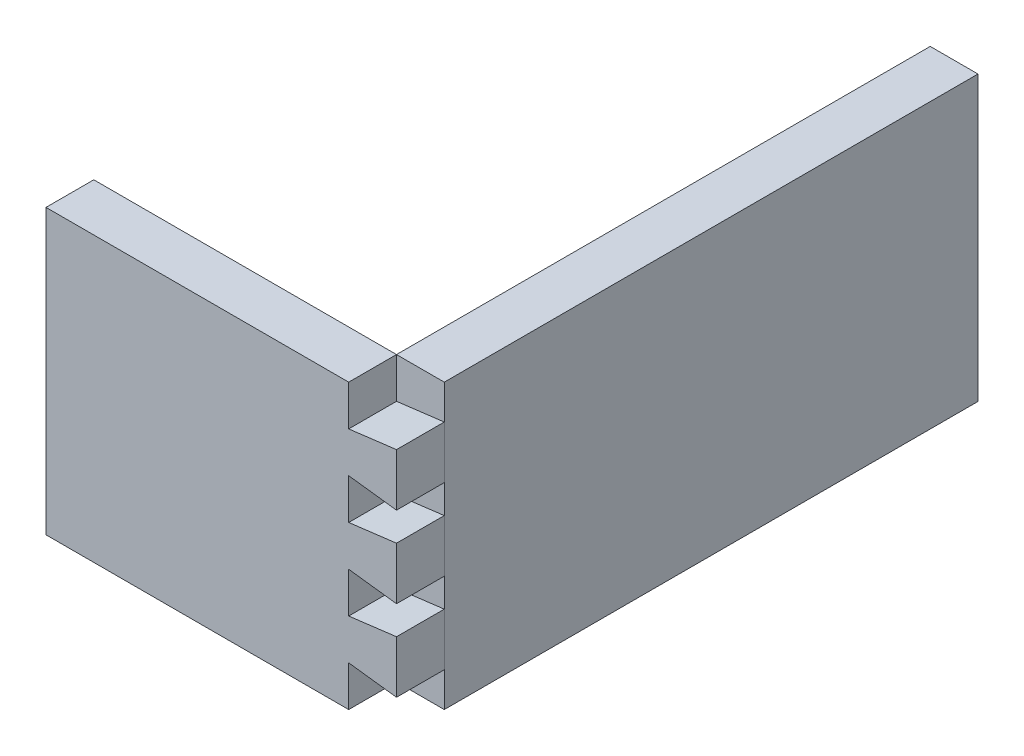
ISO-10303-21;
HEADER;
FILE_DESCRIPTION(('STEP AP214'),'2;1');
FILE_NAME('part.step','',(''),(''),'','','');
FILE_SCHEMA(('AUTOMOTIVE_DESIGN { 1 0 10303 214 1 1 1 1 }'));
ENDSEC;
DATA;
#1=APPLICATION_CONTEXT('core data for automotive mechanical design processes');
#2=APPLICATION_PROTOCOL_DEFINITION('international standard','automotive_design',2000,#1);
#3=PRODUCT_CONTEXT('',#1,'mechanical');
#4=PRODUCT('Part','Part','',(#3));
#5=PRODUCT_RELATED_PRODUCT_CATEGORY('part','',(#4));
#6=PRODUCT_DEFINITION_FORMATION('','',#4);
#7=PRODUCT_DEFINITION_CONTEXT('part definition',#1,'design');
#8=PRODUCT_DEFINITION('design','',#6,#7);
#9=PRODUCT_DEFINITION_SHAPE('','',#8);
#10=(LENGTH_UNIT() NAMED_UNIT(*) SI_UNIT(.MILLI.,.METRE.));
#11=(NAMED_UNIT(*) PLANE_ANGLE_UNIT() SI_UNIT($,.RADIAN.));
#12=(NAMED_UNIT(*) SI_UNIT($,.STERADIAN.) SOLID_ANGLE_UNIT());
#13=UNCERTAINTY_MEASURE_WITH_UNIT(LENGTH_MEASURE(1.E-05),#10,'distance_accuracy_value','');
#14=(GEOMETRIC_REPRESENTATION_CONTEXT(3) GLOBAL_UNCERTAINTY_ASSIGNED_CONTEXT((#13)) GLOBAL_UNIT_ASSIGNED_CONTEXT((#10,
#11,#12)) REPRESENTATION_CONTEXT('',''));
#15=CARTESIAN_POINT('',(0.,0.,0.));
#16=DIRECTION('',(0.,0.,1.));
#17=DIRECTION('',(1.,0.,0.));
#18=AXIS2_PLACEMENT_3D('',#15,#16,#17);
#19=CARTESIAN_POINT('',(0.,0.,0.));
#20=DIRECTION('',(0.,0.,-1.));
#21=DIRECTION('',(-1.,0.,0.));
#22=AXIS2_PLACEMENT_3D('',#19,#20,#21);
#23=PLANE('',#22);
#24=DIRECTION('',(0.,-1.,0.));
#25=VECTOR('',#24,1.);
#26=CARTESIAN_POINT('',(0.,89.,0.));
#27=LINE('',#26,#25);
#28=CARTESIAN_POINT('',(0.,89.,0.));
#29=VERTEX_POINT('',#28);
#30=CARTESIAN_POINT('',(0.,0.,0.));
#31=VERTEX_POINT('',#30);
#32=EDGE_CURVE('E12',#29,#31,#27,.T.);
#33=ORIENTED_EDGE('',*,*,#32,.F.);
#34=DIRECTION('',(1.,0.,0.));
#35=VECTOR('',#34,1.);
#36=CARTESIAN_POINT('',(0.,89.,0.));
#37=LINE('',#36,#35);
#38=CARTESIAN_POINT('',(-15.,89.,0.));
#39=VERTEX_POINT('',#38);
#40=EDGE_CURVE('E96',#39,#29,#37,.T.);
#41=ORIENTED_EDGE('',*,*,#40,.F.);
#42=DIRECTION('',(0.,1.,0.));
#43=VECTOR('',#42,1.);
#44=CARTESIAN_POINT('',(-15.,89.,0.));
#45=LINE('',#44,#43);
#46=CARTESIAN_POINT('',(-15.,0.,0.));
#47=VERTEX_POINT('',#46);
#48=EDGE_CURVE('E50',#47,#39,#45,.T.);
#49=ORIENTED_EDGE('',*,*,#48,.F.);
#50=DIRECTION('',(-1.,0.,0.));
#51=VECTOR('',#50,1.);
#52=CARTESIAN_POINT('',(0.,0.,0.));
#53=LINE('',#52,#51);
#54=EDGE_CURVE('E56',#31,#47,#53,.T.);
#55=ORIENTED_EDGE('',*,*,#54,.F.);
#56=EDGE_LOOP('',(#33,#41,#49,#55));
#57=FACE_BOUND('',#56,.T.);
#58=ADVANCED_FACE('F47',(#57),#23,.F.);
#59=CARTESIAN_POINT('',(0.,0.,-167.5));
#60=DIRECTION('',(0.,0.,-1.));
#61=DIRECTION('',(-1.,0.,0.));
#62=AXIS2_PLACEMENT_3D('',#59,#60,#61);
#63=PLANE('',#62);
#64=DIRECTION('',(0.,-1.,0.));
#65=VECTOR('',#64,1.);
#66=CARTESIAN_POINT('',(0.,89.,-167.5));
#67=LINE('',#66,#65);
#68=CARTESIAN_POINT('',(0.,89.,-167.5));
#69=VERTEX_POINT('',#68);
#70=CARTESIAN_POINT('',(0.,0.,-167.5));
#71=VERTEX_POINT('',#70);
#72=EDGE_CURVE('E88',#69,#71,#67,.T.);
#73=ORIENTED_EDGE('',*,*,#72,.T.);
#74=DIRECTION('',(-1.,0.,0.));
#75=VECTOR('',#74,1.);
#76=CARTESIAN_POINT('',(0.,0.,-167.5));
#77=LINE('',#76,#75);
#78=CARTESIAN_POINT('',(-15.,0.,-167.5));
#79=VERTEX_POINT('',#78);
#80=EDGE_CURVE('E78',#71,#79,#77,.T.);
#81=ORIENTED_EDGE('',*,*,#80,.T.);
#82=DIRECTION('',(0.,1.,0.));
#83=VECTOR('',#82,1.);
#84=CARTESIAN_POINT('',(-15.,89.,-167.5));
#85=LINE('',#84,#83);
#86=CARTESIAN_POINT('',(-15.,89.,-167.5));
#87=VERTEX_POINT('',#86);
#88=EDGE_CURVE('E89',#79,#87,#85,.T.);
#89=ORIENTED_EDGE('',*,*,#88,.T.);
#90=DIRECTION('',(1.,0.,0.));
#91=VECTOR('',#90,1.);
#92=CARTESIAN_POINT('',(0.,89.,-167.5));
#93=LINE('',#92,#91);
#94=EDGE_CURVE('E94',#87,#69,#93,.T.);
#95=ORIENTED_EDGE('',*,*,#94,.T.);
#96=EDGE_LOOP('',(#73,#81,#89,#95));
#97=FACE_BOUND('',#96,.T.);
#98=ADVANCED_FACE('F92',(#97),#63,.T.);
#99=CARTESIAN_POINT('',(0.,89.,-167.5));
#100=DIRECTION('',(0.,-1.,0.));
#101=DIRECTION('',(0.,0.,-1.));
#102=AXIS2_PLACEMENT_3D('',#99,#100,#101);
#103=PLANE('',#102);
#104=ORIENTED_EDGE('',*,*,#40,.T.);
#105=DIRECTION('',(0.,0.,1.));
#106=VECTOR('',#105,1.);
#107=CARTESIAN_POINT('',(0.,89.,-167.5));
#108=LINE('',#107,#106);
#109=EDGE_CURVE('E105',#69,#29,#108,.T.);
#110=ORIENTED_EDGE('',*,*,#109,.F.);
#111=ORIENTED_EDGE('',*,*,#94,.F.);
#112=DIRECTION('',(0.,0.,1.));
#113=VECTOR('',#112,1.);
#114=CARTESIAN_POINT('',(-15.,89.,-167.5));
#115=LINE('',#114,#113);
#116=EDGE_CURVE('E100',#87,#39,#115,.T.);
#117=ORIENTED_EDGE('',*,*,#116,.T.);
#118=EDGE_LOOP('',(#104,#110,#111,#117));
#119=FACE_BOUND('',#118,.T.);
#120=ADVANCED_FACE('F118',(#119),#103,.F.);
#121=CARTESIAN_POINT('',(0.,89.,-167.5));
#122=DIRECTION('',(-1.,0.,0.));
#123=DIRECTION('',(0.,-1.,0.));
#124=AXIS2_PLACEMENT_3D('',#121,#122,#123);
#125=PLANE('',#124);
#126=ORIENTED_EDGE('',*,*,#109,.T.);
#127=ORIENTED_EDGE('',*,*,#32,.T.);
#128=DIRECTION('',(0.,0.,1.));
#129=VECTOR('',#128,1.);
#130=CARTESIAN_POINT('',(0.,0.,-167.5));
#131=LINE('',#130,#129);
#132=EDGE_CURVE('E84',#71,#31,#131,.T.);
#133=ORIENTED_EDGE('',*,*,#132,.F.);
#134=ORIENTED_EDGE('',*,*,#72,.F.);
#135=EDGE_LOOP('',(#126,#127,#133,#134));
#136=FACE_BOUND('',#135,.T.);
#137=ADVANCED_FACE('F98',(#136),#125,.F.);
#138=CARTESIAN_POINT('',(0.,0.,-167.5));
#139=DIRECTION('',(0.,1.,0.));
#140=DIRECTION('',(-1.,0.,0.));
#141=AXIS2_PLACEMENT_3D('',#138,#139,#140);
#142=PLANE('',#141);
#143=ORIENTED_EDGE('',*,*,#54,.T.);
#144=DIRECTION('',(0.,0.,1.));
#145=VECTOR('',#144,1.);
#146=CARTESIAN_POINT('',(-15.,0.,-167.5));
#147=LINE('',#146,#145);
#148=EDGE_CURVE('E86',#79,#47,#147,.T.);
#149=ORIENTED_EDGE('',*,*,#148,.F.);
#150=ORIENTED_EDGE('',*,*,#80,.F.);
#151=ORIENTED_EDGE('',*,*,#132,.T.);
#152=EDGE_LOOP('',(#143,#149,#150,#151));
#153=FACE_BOUND('',#152,.T.);
#154=ADVANCED_FACE('F83',(#153),#142,.F.);
#155=CARTESIAN_POINT('',(-15.,89.,-167.5));
#156=DIRECTION('',(1.,0.,0.));
#157=DIRECTION('',(0.,1.,0.));
#158=AXIS2_PLACEMENT_3D('',#155,#156,#157);
#159=PLANE('',#158);
#160=ORIENTED_EDGE('',*,*,#148,.T.);
#161=ORIENTED_EDGE('',*,*,#48,.T.);
#162=ORIENTED_EDGE('',*,*,#116,.F.);
#163=ORIENTED_EDGE('',*,*,#88,.F.);
#164=EDGE_LOOP('',(#160,#161,#162,#163));
#165=FACE_BOUND('',#164,.T.);
#166=ADVANCED_FACE('F114',(#165),#159,.F.);
#167=CLOSED_SHELL('',(#58,#98,#120,#137,#154,#166));
#168=MANIFOLD_SOLID_BREP('B2',#167);
#169=CARTESIAN_POINT('',(0.,0.,0.));
#170=DIRECTION('',(0.,0.,-1.));
#171=DIRECTION('',(-1.,0.,0.));
#172=AXIS2_PLACEMENT_3D('',#169,#170,#171);
#173=PLANE('',#172);
#174=DIRECTION('',(0.,-1.,0.));
#175=VECTOR('',#174,1.);
#176=CARTESIAN_POINT('',(0.,89.,0.));
#177=LINE('',#176,#175);
#178=CARTESIAN_POINT('',(0.,78.1607142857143,0.));
#179=VERTEX_POINT('',#178);
#180=CARTESIAN_POINT('',(0.,61.6964285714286,0.));
#181=VERTEX_POINT('',#180);
#182=EDGE_CURVE('E182',#179,#181,#177,.T.);
#183=ORIENTED_EDGE('',*,*,#182,.T.);
#184=DIRECTION('',(0.992277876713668,-0.124034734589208,0.));
#185=VECTOR('',#184,1.);
#186=CARTESIAN_POINT('',(-15.,63.5714285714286,0.));
#187=LINE('',#186,#185);
#188=CARTESIAN_POINT('',(-15.,63.5714285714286,0.));
#189=VERTEX_POINT('',#188);
#190=EDGE_CURVE('E197',#189,#181,#187,.T.);
#191=ORIENTED_EDGE('',*,*,#190,.F.);
#192=DIRECTION('',(0.,1.,0.));
#193=VECTOR('',#192,1.);
#194=CARTESIAN_POINT('',(-15.,89.,0.));
#195=LINE('',#194,#193);
#196=CARTESIAN_POINT('',(-15.,50.8571428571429,0.));
#197=VERTEX_POINT('',#196);
#198=EDGE_CURVE('E351',#197,#189,#195,.T.);
#199=ORIENTED_EDGE('',*,*,#198,.F.);
#200=DIRECTION('',(-0.992277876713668,-0.124034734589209,0.));
#201=VECTOR('',#200,1.);
#202=CARTESIAN_POINT('',(0.,52.7321428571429,0.));
#203=LINE('',#202,#201);
#204=CARTESIAN_POINT('',(0.,52.7321428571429,0.));
#205=VERTEX_POINT('',#204);
#206=EDGE_CURVE('E396',#205,#197,#203,.T.);
#207=ORIENTED_EDGE('',*,*,#206,.F.);
#208=CARTESIAN_POINT('',(0.,36.2678571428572,0.));
#209=VERTEX_POINT('',#208);
#210=EDGE_CURVE('E180',#205,#209,#177,.T.);
#211=ORIENTED_EDGE('',*,*,#210,.T.);
#212=DIRECTION('',(0.992277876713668,-0.124034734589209,0.));
#213=VECTOR('',#212,1.);
#214=CARTESIAN_POINT('',(0.,36.2678571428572,0.));
#215=LINE('',#214,#213);
#216=CARTESIAN_POINT('',(-15.,38.1428571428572,0.));
#217=VERTEX_POINT('',#216);
#218=EDGE_CURVE('E394',#217,#209,#215,.T.);
#219=ORIENTED_EDGE('',*,*,#218,.F.);
#220=CARTESIAN_POINT('',(-15.,25.4285714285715,0.));
#221=VERTEX_POINT('',#220);
#222=EDGE_CURVE('E294',#221,#217,#195,.T.);
#223=ORIENTED_EDGE('',*,*,#222,.F.);
#224=DIRECTION('',(-0.992277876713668,-0.124034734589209,0.));
#225=VECTOR('',#224,1.);
#226=CARTESIAN_POINT('',(-15.,25.4285714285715,0.));
#227=LINE('',#226,#225);
#228=CARTESIAN_POINT('',(0.,27.3035714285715,0.));
#229=VERTEX_POINT('',#228);
#230=EDGE_CURVE('E392',#229,#221,#227,.T.);
#231=ORIENTED_EDGE('',*,*,#230,.F.);
#232=CARTESIAN_POINT('',(0.,10.8392857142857,0.));
#233=VERTEX_POINT('',#232);
#234=EDGE_CURVE('E45',#229,#233,#177,.T.);
#235=ORIENTED_EDGE('',*,*,#234,.T.);
#236=DIRECTION('',(0.992277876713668,-0.124034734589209,0.));
#237=VECTOR('',#236,1.);
#238=CARTESIAN_POINT('',(0.,10.8392857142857,0.));
#239=LINE('',#238,#237);
#240=CARTESIAN_POINT('',(-15.,12.7142857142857,0.));
#241=VERTEX_POINT('',#240);
#242=EDGE_CURVE('E290',#241,#233,#239,.T.);
#243=ORIENTED_EDGE('',*,*,#242,.F.);
#244=CARTESIAN_POINT('',(-15.,0.,0.));
#245=VERTEX_POINT('',#244);
#246=EDGE_CURVE('E285',#245,#241,#195,.T.);
#247=ORIENTED_EDGE('',*,*,#246,.F.);
#248=DIRECTION('',(-1.,0.,0.));
#249=VECTOR('',#248,1.);
#250=CARTESIAN_POINT('',(0.,0.,0.));
#251=LINE('',#250,#249);
#252=CARTESIAN_POINT('',(-110.,0.,0.));
#253=VERTEX_POINT('',#252);
#254=EDGE_CURVE('E288',#245,#253,#251,.T.);
#255=ORIENTED_EDGE('',*,*,#254,.T.);
#256=DIRECTION('',(0.,1.,0.));
#257=VECTOR('',#256,1.);
#258=CARTESIAN_POINT('',(-110.,0.,0.));
#259=LINE('',#258,#257);
#260=CARTESIAN_POINT('',(-110.,89.,0.));
#261=VERTEX_POINT('',#260);
#262=EDGE_CURVE('E303',#253,#261,#259,.T.);
#263=ORIENTED_EDGE('',*,*,#262,.T.);
#264=DIRECTION('',(-1.,0.,0.));
#265=VECTOR('',#264,1.);
#266=CARTESIAN_POINT('',(0.,89.,0.));
#267=LINE('',#266,#265);
#268=CARTESIAN_POINT('',(-15.,89.,0.));
#269=VERTEX_POINT('',#268);
#270=EDGE_CURVE('E337',#269,#261,#267,.T.);
#271=ORIENTED_EDGE('',*,*,#270,.F.);
#272=CARTESIAN_POINT('',(-15.,76.2857142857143,0.));
#273=VERTEX_POINT('',#272);
#274=EDGE_CURVE('E296',#273,#269,#195,.T.);
#275=ORIENTED_EDGE('',*,*,#274,.F.);
#276=DIRECTION('',(-0.992277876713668,-0.124034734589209,0.));
#277=VECTOR('',#276,1.);
#278=CARTESIAN_POINT('',(-15.,76.2857142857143,0.));
#279=LINE('',#278,#277);
#280=EDGE_CURVE('E189',#179,#273,#279,.T.);
#281=ORIENTED_EDGE('',*,*,#280,.F.);
#282=EDGE_LOOP('',(#183,#191,#199,#207,#211,#219,#223,#231,#235,#243,#247,#255,#263,#271,#275,#281));
#283=FACE_BOUND('',#282,.T.);
#284=ADVANCED_FACE('F171',(#283),#173,.T.);
#285=CARTESIAN_POINT('',(0.,89.,15.));
#286=DIRECTION('',(0.,-1.,0.));
#287=DIRECTION('',(1.,0.,0.));
#288=AXIS2_PLACEMENT_3D('',#285,#286,#287);
#289=PLANE('',#288);
#290=DIRECTION('',(-1.,0.,0.));
#291=VECTOR('',#290,1.);
#292=CARTESIAN_POINT('',(0.,89.,15.));
#293=LINE('',#292,#291);
#294=CARTESIAN_POINT('',(-15.,89.,15.));
#295=VERTEX_POINT('',#294);
#296=CARTESIAN_POINT('',(-110.,89.,15.));
#297=VERTEX_POINT('',#296);
#298=EDGE_CURVE('E340',#295,#297,#293,.T.);
#299=ORIENTED_EDGE('',*,*,#298,.F.);
#300=DIRECTION('',(0.,0.,-1.));
#301=VECTOR('',#300,1.);
#302=CARTESIAN_POINT('',(-15.,89.,15.));
#303=LINE('',#302,#301);
#304=EDGE_CURVE('E325',#295,#269,#303,.T.);
#305=ORIENTED_EDGE('',*,*,#304,.T.);
#306=ORIENTED_EDGE('',*,*,#270,.T.);
#307=DIRECTION('',(0.,0.,-1.));
#308=VECTOR('',#307,1.);
#309=CARTESIAN_POINT('',(-110.,89.,15.));
#310=LINE('',#309,#308);
#311=EDGE_CURVE('E347',#297,#261,#310,.T.);
#312=ORIENTED_EDGE('',*,*,#311,.F.);
#313=EDGE_LOOP('',(#299,#305,#306,#312));
#314=FACE_BOUND('',#313,.T.);
#315=ADVANCED_FACE('F421',(#314),#289,.F.);
#316=CARTESIAN_POINT('',(-15.,12.7142857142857,15.));
#317=DIRECTION('',(-1.,0.,0.));
#318=DIRECTION('',(0.,-1.,0.));
#319=AXIS2_PLACEMENT_3D('',#316,#317,#318);
#320=PLANE('',#319);
#321=ORIENTED_EDGE('',*,*,#246,.T.);
#322=DIRECTION('',(0.,0.,-1.));
#323=VECTOR('',#322,1.);
#324=CARTESIAN_POINT('',(-15.,12.7142857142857,15.));
#325=LINE('',#324,#323);
#326=CARTESIAN_POINT('',(-15.,12.7142857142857,15.));
#327=VERTEX_POINT('',#326);
#328=EDGE_CURVE('E309',#327,#241,#325,.T.);
#329=ORIENTED_EDGE('',*,*,#328,.F.);
#330=DIRECTION('',(0.,1.,0.));
#331=VECTOR('',#330,1.);
#332=CARTESIAN_POINT('',(-15.,12.7142857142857,15.));
#333=LINE('',#332,#331);
#334=CARTESIAN_POINT('',(-15.,0.,15.));
#335=VERTEX_POINT('',#334);
#336=EDGE_CURVE('E308',#335,#327,#333,.T.);
#337=ORIENTED_EDGE('',*,*,#336,.F.);
#338=DIRECTION('',(0.,0.,-1.));
#339=VECTOR('',#338,1.);
#340=CARTESIAN_POINT('',(-15.,0.,15.));
#341=LINE('',#340,#339);
#342=EDGE_CURVE('E299',#335,#245,#341,.T.);
#343=ORIENTED_EDGE('',*,*,#342,.T.);
#344=EDGE_LOOP('',(#321,#329,#337,#343));
#345=FACE_BOUND('',#344,.T.);
#346=ADVANCED_FACE('F306',(#345),#320,.F.);
#347=CARTESIAN_POINT('',(-15.,50.8571428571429,15.));
#348=DIRECTION('',(-1.,0.,0.));
#349=DIRECTION('',(0.,0.,1.));
#350=AXIS2_PLACEMENT_3D('',#347,#348,#349);
#351=PLANE('',#350);
#352=ORIENTED_EDGE('',*,*,#198,.T.);
#353=DIRECTION('',(0.,0.,-1.));
#354=VECTOR('',#353,1.);
#355=CARTESIAN_POINT('',(-15.,63.5714285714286,15.));
#356=LINE('',#355,#354);
#357=CARTESIAN_POINT('',(-15.,63.5714285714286,15.));
#358=VERTEX_POINT('',#357);
#359=EDGE_CURVE('E381',#358,#189,#356,.T.);
#360=ORIENTED_EDGE('',*,*,#359,.F.);
#361=DIRECTION('',(0.,1.,0.));
#362=VECTOR('',#361,1.);
#363=CARTESIAN_POINT('',(-15.,50.8571428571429,15.));
#364=LINE('',#363,#362);
#365=CARTESIAN_POINT('',(-15.,50.8571428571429,15.));
#366=VERTEX_POINT('',#365);
#367=EDGE_CURVE('E398',#366,#358,#364,.T.);
#368=ORIENTED_EDGE('',*,*,#367,.F.);
#369=DIRECTION('',(0.,0.,-1.));
#370=VECTOR('',#369,1.);
#371=CARTESIAN_POINT('',(-15.,50.8571428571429,15.));
#372=LINE('',#371,#370);
#373=EDGE_CURVE('E322',#366,#197,#372,.T.);
#374=ORIENTED_EDGE('',*,*,#373,.T.);
#375=EDGE_LOOP('',(#352,#360,#368,#374));
#376=FACE_BOUND('',#375,.T.);
#377=ADVANCED_FACE('F444',(#376),#351,.F.);
#378=CARTESIAN_POINT('',(0.,0.,15.));
#379=DIRECTION('',(0.,0.,-1.));
#380=DIRECTION('',(-1.,0.,0.));
#381=AXIS2_PLACEMENT_3D('',#378,#379,#380);
#382=PLANE('',#381);
#383=DIRECTION('',(0.,1.,0.));
#384=VECTOR('',#383,1.);
#385=CARTESIAN_POINT('',(0.,0.,15.));
#386=LINE('',#385,#384);
#387=CARTESIAN_POINT('',(0.,36.2678571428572,15.));
#388=VERTEX_POINT('',#387);
#389=CARTESIAN_POINT('',(0.,52.7321428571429,15.));
#390=VERTEX_POINT('',#389);
#391=EDGE_CURVE('E343',#388,#390,#386,.T.);
#392=ORIENTED_EDGE('',*,*,#391,.T.);
#393=DIRECTION('',(-0.992277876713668,-0.124034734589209,0.));
#394=VECTOR('',#393,1.);
#395=CARTESIAN_POINT('',(0.,52.7321428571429,15.));
#396=LINE('',#395,#394);
#397=EDGE_CURVE('E362',#390,#366,#396,.T.);
#398=ORIENTED_EDGE('',*,*,#397,.T.);
#399=ORIENTED_EDGE('',*,*,#367,.T.);
#400=DIRECTION('',(0.992277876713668,-0.124034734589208,0.));
#401=VECTOR('',#400,1.);
#402=CARTESIAN_POINT('',(-15.,63.5714285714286,15.));
#403=LINE('',#402,#401);
#404=CARTESIAN_POINT('',(0.,61.6964285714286,15.));
#405=VERTEX_POINT('',#404);
#406=EDGE_CURVE('E435',#358,#405,#403,.T.);
#407=ORIENTED_EDGE('',*,*,#406,.T.);
#408=CARTESIAN_POINT('',(0.,78.1607142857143,15.));
#409=VERTEX_POINT('',#408);
#410=EDGE_CURVE('E342',#405,#409,#386,.T.);
#411=ORIENTED_EDGE('',*,*,#410,.T.);
#412=DIRECTION('',(-0.992277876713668,-0.124034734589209,0.));
#413=VECTOR('',#412,1.);
#414=CARTESIAN_POINT('',(-15.,76.2857142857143,15.));
#415=LINE('',#414,#413);
#416=CARTESIAN_POINT('',(-15.,76.2857142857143,15.));
#417=VERTEX_POINT('',#416);
#418=EDGE_CURVE('E321',#409,#417,#415,.T.);
#419=ORIENTED_EDGE('',*,*,#418,.T.);
#420=DIRECTION('',(0.,1.,0.));
#421=VECTOR('',#420,1.);
#422=CARTESIAN_POINT('',(-15.,89.,15.));
#423=LINE('',#422,#421);
#424=EDGE_CURVE('E318',#417,#295,#423,.T.);
#425=ORIENTED_EDGE('',*,*,#424,.T.);
#426=ORIENTED_EDGE('',*,*,#298,.T.);
#427=DIRECTION('',(0.,1.,0.));
#428=VECTOR('',#427,1.);
#429=CARTESIAN_POINT('',(-110.,0.,15.));
#430=LINE('',#429,#428);
#431=CARTESIAN_POINT('',(-110.,0.,15.));
#432=VERTEX_POINT('',#431);
#433=EDGE_CURVE('E336',#432,#297,#430,.T.);
#434=ORIENTED_EDGE('',*,*,#433,.F.);
#435=DIRECTION('',(-1.,0.,0.));
#436=VECTOR('',#435,1.);
#437=CARTESIAN_POINT('',(0.,0.,15.));
#438=LINE('',#437,#436);
#439=EDGE_CURVE('E334',#335,#432,#438,.T.);
#440=ORIENTED_EDGE('',*,*,#439,.F.);
#441=ORIENTED_EDGE('',*,*,#336,.T.);
#442=DIRECTION('',(0.992277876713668,-0.124034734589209,0.));
#443=VECTOR('',#442,1.);
#444=CARTESIAN_POINT('',(0.,10.8392857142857,15.));
#445=LINE('',#444,#443);
#446=CARTESIAN_POINT('',(0.,10.8392857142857,15.));
#447=VERTEX_POINT('',#446);
#448=EDGE_CURVE('E310',#327,#447,#445,.T.);
#449=ORIENTED_EDGE('',*,*,#448,.T.);
#450=CARTESIAN_POINT('',(0.,27.3035714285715,15.));
#451=VERTEX_POINT('',#450);
#452=EDGE_CURVE('E344',#447,#451,#386,.T.);
#453=ORIENTED_EDGE('',*,*,#452,.T.);
#454=DIRECTION('',(-0.992277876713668,-0.124034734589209,0.));
#455=VECTOR('',#454,1.);
#456=CARTESIAN_POINT('',(-15.,25.4285714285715,15.));
#457=LINE('',#456,#455);
#458=CARTESIAN_POINT('',(-15.,25.4285714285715,15.));
#459=VERTEX_POINT('',#458);
#460=EDGE_CURVE('E386',#451,#459,#457,.T.);
#461=ORIENTED_EDGE('',*,*,#460,.T.);
#462=DIRECTION('',(0.,1.,0.));
#463=VECTOR('',#462,1.);
#464=CARTESIAN_POINT('',(-15.,38.1428571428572,15.));
#465=LINE('',#464,#463);
#466=CARTESIAN_POINT('',(-15.,38.1428571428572,15.));
#467=VERTEX_POINT('',#466);
#468=EDGE_CURVE('E388',#459,#467,#465,.T.);
#469=ORIENTED_EDGE('',*,*,#468,.T.);
#470=DIRECTION('',(0.992277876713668,-0.124034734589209,0.));
#471=VECTOR('',#470,1.);
#472=CARTESIAN_POINT('',(0.,36.2678571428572,15.));
#473=LINE('',#472,#471);
#474=EDGE_CURVE('E365',#467,#388,#473,.T.);
#475=ORIENTED_EDGE('',*,*,#474,.T.);
#476=EDGE_LOOP('',(#392,#398,#399,#407,#411,#419,#425,#426,#434,#440,#441,#449,#453,#461,#469,#475));
#477=FACE_BOUND('',#476,.T.);
#478=ADVANCED_FACE('F360',(#477),#382,.F.);
#479=CARTESIAN_POINT('',(0.,0.,15.));
#480=DIRECTION('',(-1.,0.,0.));
#481=DIRECTION('',(0.,-1.,0.));
#482=AXIS2_PLACEMENT_3D('',#479,#480,#481);
#483=PLANE('',#482);
#484=ORIENTED_EDGE('',*,*,#410,.F.);
#485=DIRECTION('',(0.,0.,-1.));
#486=VECTOR('',#485,1.);
#487=CARTESIAN_POINT('',(0.,61.6964285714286,15.));
#488=LINE('',#487,#486);
#489=EDGE_CURVE('E376',#405,#181,#488,.T.);
#490=ORIENTED_EDGE('',*,*,#489,.T.);
#491=ORIENTED_EDGE('',*,*,#182,.F.);
#492=DIRECTION('',(0.,0.,-1.));
#493=VECTOR('',#492,1.);
#494=CARTESIAN_POINT('',(0.,78.1607142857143,15.));
#495=LINE('',#494,#493);
#496=EDGE_CURVE('E329',#409,#179,#495,.T.);
#497=ORIENTED_EDGE('',*,*,#496,.F.);
#498=EDGE_LOOP('',(#484,#490,#491,#497));
#499=FACE_BOUND('',#498,.T.);
#500=ADVANCED_FACE('F432',(#499),#483,.F.);
#501=CARTESIAN_POINT('',(-15.,63.5714285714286,15.));
#502=DIRECTION('',(0.124034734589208,0.992277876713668,0.));
#503=DIRECTION('',(-0.992277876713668,0.124034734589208,0.));
#504=AXIS2_PLACEMENT_3D('',#501,#502,#503);
#505=PLANE('',#504);
#506=ORIENTED_EDGE('',*,*,#190,.T.);
#507=ORIENTED_EDGE('',*,*,#489,.F.);
#508=ORIENTED_EDGE('',*,*,#406,.F.);
#509=ORIENTED_EDGE('',*,*,#359,.T.);
#510=EDGE_LOOP('',(#506,#507,#508,#509));
#511=FACE_BOUND('',#510,.T.);
#512=ADVANCED_FACE('F440',(#511),#505,.F.);
#513=CARTESIAN_POINT('',(-15.,89.,15.));
#514=DIRECTION('',(-1.,0.,0.));
#515=DIRECTION('',(0.,-1.,0.));
#516=AXIS2_PLACEMENT_3D('',#513,#514,#515);
#517=PLANE('',#516);
#518=ORIENTED_EDGE('',*,*,#274,.T.);
#519=ORIENTED_EDGE('',*,*,#304,.F.);
#520=ORIENTED_EDGE('',*,*,#424,.F.);
#521=DIRECTION('',(0.,0.,-1.));
#522=VECTOR('',#521,1.);
#523=CARTESIAN_POINT('',(-15.,76.2857142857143,15.));
#524=LINE('',#523,#522);
#525=EDGE_CURVE('E304',#417,#273,#524,.T.);
#526=ORIENTED_EDGE('',*,*,#525,.T.);
#527=EDGE_LOOP('',(#518,#519,#520,#526));
#528=FACE_BOUND('',#527,.T.);
#529=ADVANCED_FACE('F424',(#528),#517,.F.);
#530=CARTESIAN_POINT('',(-15.,76.2857142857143,15.));
#531=DIRECTION('',(0.124034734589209,-0.992277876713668,0.));
#532=DIRECTION('',(0.992277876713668,0.124034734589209,0.));
#533=AXIS2_PLACEMENT_3D('',#530,#531,#532);
#534=PLANE('',#533);
#535=ORIENTED_EDGE('',*,*,#280,.T.);
#536=ORIENTED_EDGE('',*,*,#525,.F.);
#537=ORIENTED_EDGE('',*,*,#418,.F.);
#538=ORIENTED_EDGE('',*,*,#496,.T.);
#539=EDGE_LOOP('',(#535,#536,#537,#538));
#540=FACE_BOUND('',#539,.T.);
#541=ADVANCED_FACE('F430',(#540),#534,.F.);
#542=ORIENTED_EDGE('',*,*,#234,.F.);
#543=DIRECTION('',(0.,0.,-1.));
#544=VECTOR('',#543,1.);
#545=CARTESIAN_POINT('',(0.,27.3035714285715,15.));
#546=LINE('',#545,#544);
#547=EDGE_CURVE('E391',#451,#229,#546,.T.);
#548=ORIENTED_EDGE('',*,*,#547,.F.);
#549=ORIENTED_EDGE('',*,*,#452,.F.);
#550=DIRECTION('',(0.,0.,-1.));
#551=VECTOR('',#550,1.);
#552=CARTESIAN_POINT('',(0.,10.8392857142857,15.));
#553=LINE('',#552,#551);
#554=EDGE_CURVE('E312',#447,#233,#553,.T.);
#555=ORIENTED_EDGE('',*,*,#554,.T.);
#556=EDGE_LOOP('',(#542,#548,#549,#555));
#557=FACE_BOUND('',#556,.T.);
#558=ADVANCED_FACE('F411',(#557),#483,.F.);
#559=CARTESIAN_POINT('',(0.,10.8392857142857,15.));
#560=DIRECTION('',(0.124034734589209,0.992277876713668,0.));
#561=DIRECTION('',(-0.992277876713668,0.124034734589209,0.));
#562=AXIS2_PLACEMENT_3D('',#559,#560,#561);
#563=PLANE('',#562);
#564=ORIENTED_EDGE('',*,*,#242,.T.);
#565=ORIENTED_EDGE('',*,*,#554,.F.);
#566=ORIENTED_EDGE('',*,*,#448,.F.);
#567=ORIENTED_EDGE('',*,*,#328,.T.);
#568=EDGE_LOOP('',(#564,#565,#566,#567));
#569=FACE_BOUND('',#568,.T.);
#570=ADVANCED_FACE('F415',(#569),#563,.F.);
#571=CARTESIAN_POINT('',(-15.,38.1428571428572,15.));
#572=DIRECTION('',(-1.,0.,0.));
#573=DIRECTION('',(0.,-1.,0.));
#574=AXIS2_PLACEMENT_3D('',#571,#572,#573);
#575=PLANE('',#574);
#576=ORIENTED_EDGE('',*,*,#222,.T.);
#577=DIRECTION('',(0.,0.,-1.));
#578=VECTOR('',#577,1.);
#579=CARTESIAN_POINT('',(-15.,38.1428571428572,15.));
#580=LINE('',#579,#578);
#581=EDGE_CURVE('E399',#467,#217,#580,.T.);
#582=ORIENTED_EDGE('',*,*,#581,.F.);
#583=ORIENTED_EDGE('',*,*,#468,.F.);
#584=DIRECTION('',(0.,0.,-1.));
#585=VECTOR('',#584,1.);
#586=CARTESIAN_POINT('',(-15.,25.4285714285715,15.));
#587=LINE('',#586,#585);
#588=EDGE_CURVE('E402',#459,#221,#587,.T.);
#589=ORIENTED_EDGE('',*,*,#588,.T.);
#590=EDGE_LOOP('',(#576,#582,#583,#589));
#591=FACE_BOUND('',#590,.T.);
#592=ADVANCED_FACE('F448',(#591),#575,.F.);
#593=CARTESIAN_POINT('',(-15.,25.4285714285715,15.));
#594=DIRECTION('',(0.124034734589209,-0.992277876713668,0.));
#595=DIRECTION('',(0.992277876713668,0.124034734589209,0.));
#596=AXIS2_PLACEMENT_3D('',#593,#594,#595);
#597=PLANE('',#596);
#598=ORIENTED_EDGE('',*,*,#230,.T.);
#599=ORIENTED_EDGE('',*,*,#588,.F.);
#600=ORIENTED_EDGE('',*,*,#460,.F.);
#601=ORIENTED_EDGE('',*,*,#547,.T.);
#602=EDGE_LOOP('',(#598,#599,#600,#601));
#603=FACE_BOUND('',#602,.T.);
#604=ADVANCED_FACE('F453',(#603),#597,.F.);
#605=ORIENTED_EDGE('',*,*,#210,.F.);
#606=DIRECTION('',(0.,0.,-1.));
#607=VECTOR('',#606,1.);
#608=CARTESIAN_POINT('',(0.,52.7321428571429,15.));
#609=LINE('',#608,#607);
#610=EDGE_CURVE('E373',#390,#205,#609,.T.);
#611=ORIENTED_EDGE('',*,*,#610,.F.);
#612=ORIENTED_EDGE('',*,*,#391,.F.);
#613=DIRECTION('',(0.,0.,-1.));
#614=VECTOR('',#613,1.);
#615=CARTESIAN_POINT('',(0.,36.2678571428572,15.));
#616=LINE('',#615,#614);
#617=EDGE_CURVE('E371',#388,#209,#616,.T.);
#618=ORIENTED_EDGE('',*,*,#617,.T.);
#619=EDGE_LOOP('',(#605,#611,#612,#618));
#620=FACE_BOUND('',#619,.T.);
#621=ADVANCED_FACE('F370',(#620),#483,.F.);
#622=CARTESIAN_POINT('',(0.,36.2678571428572,15.));
#623=DIRECTION('',(0.124034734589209,0.992277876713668,0.));
#624=DIRECTION('',(-0.992277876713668,0.124034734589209,0.));
#625=AXIS2_PLACEMENT_3D('',#622,#623,#624);
#626=PLANE('',#625);
#627=ORIENTED_EDGE('',*,*,#218,.T.);
#628=ORIENTED_EDGE('',*,*,#617,.F.);
#629=ORIENTED_EDGE('',*,*,#474,.F.);
#630=ORIENTED_EDGE('',*,*,#581,.T.);
#631=EDGE_LOOP('',(#627,#628,#629,#630));
#632=FACE_BOUND('',#631,.T.);
#633=ADVANCED_FACE('F451',(#632),#626,.F.);
#634=CARTESIAN_POINT('',(0.,52.7321428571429,15.));
#635=DIRECTION('',(0.124034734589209,-0.992277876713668,0.));
#636=DIRECTION('',(0.992277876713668,0.124034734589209,0.));
#637=AXIS2_PLACEMENT_3D('',#634,#635,#636);
#638=PLANE('',#637);
#639=ORIENTED_EDGE('',*,*,#206,.T.);
#640=ORIENTED_EDGE('',*,*,#373,.F.);
#641=ORIENTED_EDGE('',*,*,#397,.F.);
#642=ORIENTED_EDGE('',*,*,#610,.T.);
#643=EDGE_LOOP('',(#639,#640,#641,#642));
#644=FACE_BOUND('',#643,.T.);
#645=ADVANCED_FACE('F465',(#644),#638,.F.);
#646=CARTESIAN_POINT('',(-110.,0.,15.));
#647=DIRECTION('',(-1.,0.,0.));
#648=DIRECTION('',(0.,0.,1.));
#649=AXIS2_PLACEMENT_3D('',#646,#647,#648);
#650=PLANE('',#649);
#651=ORIENTED_EDGE('',*,*,#262,.F.);
#652=DIRECTION('',(0.,0.,-1.));
#653=VECTOR('',#652,1.);
#654=CARTESIAN_POINT('',(-110.,0.,15.));
#655=LINE('',#654,#653);
#656=EDGE_CURVE('E175',#432,#253,#655,.T.);
#657=ORIENTED_EDGE('',*,*,#656,.F.);
#658=ORIENTED_EDGE('',*,*,#433,.T.);
#659=ORIENTED_EDGE('',*,*,#311,.T.);
#660=EDGE_LOOP('',(#651,#657,#658,#659));
#661=FACE_BOUND('',#660,.T.);
#662=ADVANCED_FACE('F417',(#661),#650,.T.);
#663=CARTESIAN_POINT('',(0.,0.,15.));
#664=DIRECTION('',(0.,-1.,0.));
#665=DIRECTION('',(1.,0.,0.));
#666=AXIS2_PLACEMENT_3D('',#663,#664,#665);
#667=PLANE('',#666);
#668=ORIENTED_EDGE('',*,*,#342,.F.);
#669=ORIENTED_EDGE('',*,*,#439,.T.);
#670=ORIENTED_EDGE('',*,*,#656,.T.);
#671=ORIENTED_EDGE('',*,*,#254,.F.);
#672=EDGE_LOOP('',(#668,#669,#670,#671));
#673=FACE_BOUND('',#672,.T.);
#674=ADVANCED_FACE('F173',(#673),#667,.T.);
#675=CLOSED_SHELL('',(#284,#315,#346,#377,#478,#500,#512,#529,#541,#558,#570,#592,#604,#621,
#633,#645,#662,#674));
#676=MANIFOLD_SOLID_BREP('B6',#675);
#677=ADVANCED_BREP_SHAPE_REPRESENTATION('',(#18,#168,#676),#14);
#678=SHAPE_DEFINITION_REPRESENTATION(#9,#677);
ENDSEC;
END-ISO-10303-21;
